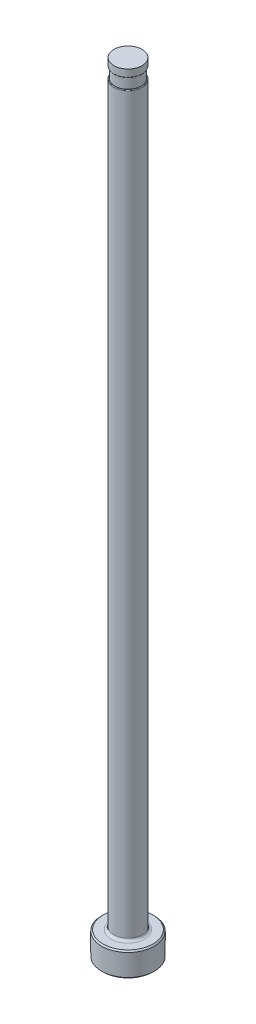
from build123d import *

# Parameters (mm, degrees)
CHAMFER1_SIZE     = 0.254
FILLET1_R         = 0.508
SKETCH2_W         = 0.2032
SKETCH2_H         = 2.032
D_SLOT_DEPTH      = 153.574351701
D_SLOT_DEPTH_BACK = 153.574351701
SKETCH5_W         = 0.0254
SKETCH5_H         = 1.524
FILLET2_R         = 0.127


with BuildPart() as part:
    # Sketch1 → Revolve1 (revolve)
    with BuildSketch(Plane.XY, mode=Mode.PRIVATE) as revolve1_sk:
        Polygon((0, 0), (-5.1562, 0), (-5.1562, 4.7498), (-2.77749, 4.7498), (-2.77749, 152.4), (0, 152.4), align=None)
    revolve(revolve1_sk.sketch.rotate(Axis((0, 259.958771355, 0), (0, -1, 0)), 270), axis=Axis((0, 259.958771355, 0), (0, -1, 0)))

    # Chamfer1
    chamfer1_edges = [part.edges().sort_by_distance(p)[0] for p in [
        (0, 4.7498, -5.1562),
        (0, 0, -5.1562),
    ]]
    chamfer(chamfer1_edges, length=CHAMFER1_SIZE)

    # Fillet1
    fillet1_edges = [part.edges().sort_by_distance(p)[0] for p in [
        (0, 4.7498, -2.77749),
    ]]
    fillet(fillet1_edges, radius=FILLET1_R)

    # Sketch2 → Vent Relief (revolve, cut)
    with BuildSketch(Plane.XY, mode=Mode.PRIVATE) as vent_relief_sk:
        with Locations((-2.67589, 149.86)):
            Rectangle(SKETCH2_W, SKETCH2_H)
    revolve(vent_relief_sk.sketch.rotate(Axis((0, 153.448281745, 0), (0, -1, 0)), 270), axis=Axis((0, 153.448281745, 0), (0, -1, 0)), mode=Mode.SUBTRACT)

    # Sketch3 → D-Slot (cut, two sides: drawn at the far end of the back side and taken through both)
    with BuildSketch(Plane.XY.offset(-D_SLOT_DEPTH_BACK)):
        with BuildLine():
            Line((-2.57429, 149.86), (-2.57429, 86.36))
            ThreePointArc((-2.57429, 86.36), (-2.625503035, 85.792038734), (-2.77749, 85.2424))
            Line((-2.77749, 85.2424), (-2.77749, 149.86))
            Line((-2.77749, 149.86), (-2.57429, 149.86))
        make_face()
    extrude(amount=D_SLOT_DEPTH + D_SLOT_DEPTH_BACK, mode=Mode.SUBTRACT)

    # Sketch5 → Vent Diameter (revolve, cut)
    with BuildSketch(Plane.XY, mode=Mode.PRIVATE) as vent_diameter_sk:
        with Locations((-2.76479, 151.638)):
            Rectangle(SKETCH5_W, SKETCH5_H)
    revolve(vent_diameter_sk.sketch.rotate(Axis((0, 152.687735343, 0), (0, -1, 0)), 90), axis=Axis((0, 152.687735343, 0), (0, -1, 0)), mode=Mode.SUBTRACT)

    # Fillet2
    fillet2_edges = [part.edges().sort_by_distance(p)[0] for p in [
        (2.303354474, 148.844, -1.552098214),
        (0, 150.876, 2.75209),
    ]]
    fillet(fillet2_edges, radius=FILLET2_R)


solid = part.part
